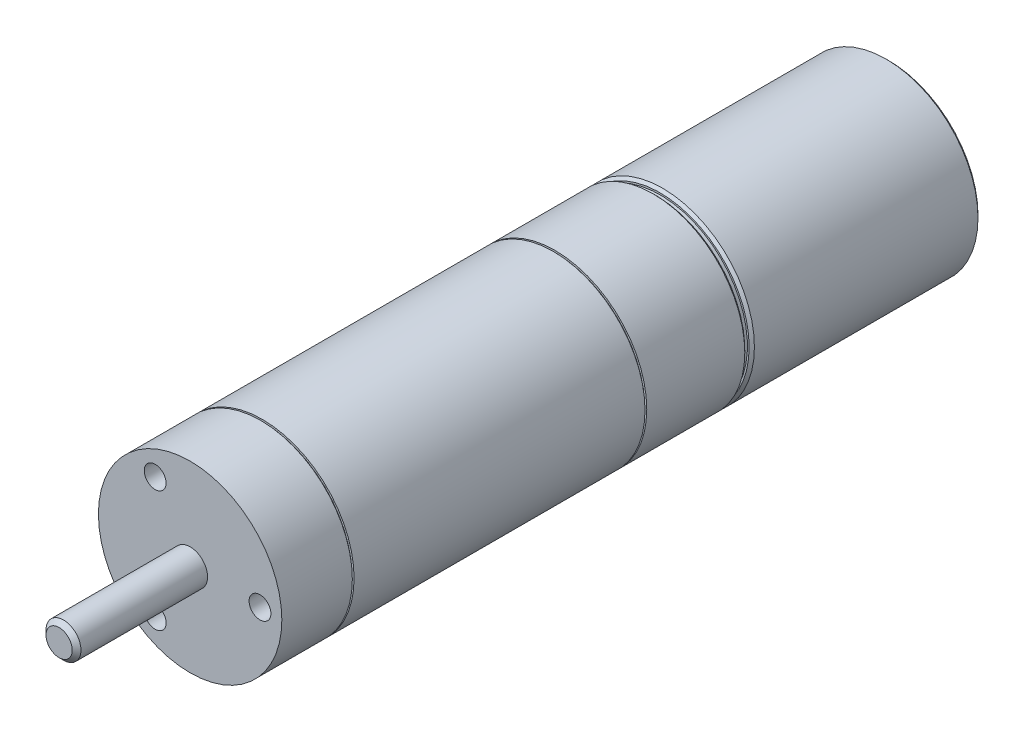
from build123d import *

# Parameters (mm, degrees)
ESQUISSE1_R             = 10.5
BOSS_EXTRU_1_DEPTH      = 80
ESQUISSE2_R             = 2
BOSS_EXTRU_2_DEPTH      = 15
CHANFREIN1_SIZE         = 0.5
ESQUISSE3_R             = 1.25
ENL_V_MAT_EXTRU_1_DEPTH = 5
ESQUISSE4_W             = 1.230691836
ESQUISSE4_H             = 0.2
ESQUISSE4_W_2           = 0.615345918
ESQUISSE4_H_2           = 0.5
CHANFREIN2_SIZE         = 0.3


with BuildPart() as part:
    # Esquisse1 → Boss.-Extru.1 (new body)
    with BuildSketch(Plane.XY):
        Circle(ESQUISSE1_R)
    extrude(amount=BOSS_EXTRU_1_DEPTH)

    # Esquisse2 → Boss.-Extru.2 (add)
    with BuildSketch(Plane.XY.offset(80)):
        Circle(ESQUISSE2_R)
    extrude(amount=BOSS_EXTRU_2_DEPTH)

    # Chanfrein1
    chanfrein1_edges = [part.edges().sort_by_distance(p)[0] for p in [
        (-2, 0, 95),
    ]]
    chamfer(chanfrein1_edges, length=CHANFREIN1_SIZE)

    # Esquisse3 → Enl_v. mat.-Extru.1 (cut)
    with BuildSketch(Plane.XY.offset(80)):
        with Locations((-4, 6.92820323)):
            Circle(ESQUISSE3_R)
        with Locations((8, 0)):
            Circle(ESQUISSE3_R)
        with Locations((-4, -6.92820323)):
            Circle(ESQUISSE3_R)
    extrude(amount=-ENL_V_MAT_EXTRU_1_DEPTH, mode=Mode.SUBTRACT)

    # Esquisse4 → Enl_vement de mati_re-R_volution1 (revolve, cut)
    with BuildSketch(Plane(origin=(0, 0, 0), x_dir=(1, 0, 0), z_dir=(0, 1, 0)), mode=Mode.PRIVATE) as enl_vement_de_mati_re_r_volution1_sk:
        with Locations((10.891583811, -71.828394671)):
            Rectangle(ESQUISSE4_W, ESQUISSE4_H)
        with Locations((10.891583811, -38.321507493)):
            Rectangle(ESQUISSE4_W, ESQUISSE4_H)
        with Locations((10.307672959, -26.44777848)):
            Rectangle(ESQUISSE4_W_2, ESQUISSE4_H_2)
    revolve(enl_vement_de_mati_re_r_volution1_sk.sketch.rotate(Axis((0, 0, -6.641145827), (0, 0, 1)), 180), axis=Axis((0, 0, -6.641145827), (0, 0, 1)), mode=Mode.SUBTRACT)

    # Chanfrein2
    chanfrein2_edges = [part.edges().sort_by_distance(p)[0] for p in [
        (-10.5, 0, 0),
        (-10.5, 0, 26.69777848),
        (-10.5, 0, 26.19777848),
    ]]
    chamfer(chanfrein2_edges, length=CHANFREIN2_SIZE)


solid = part.part
